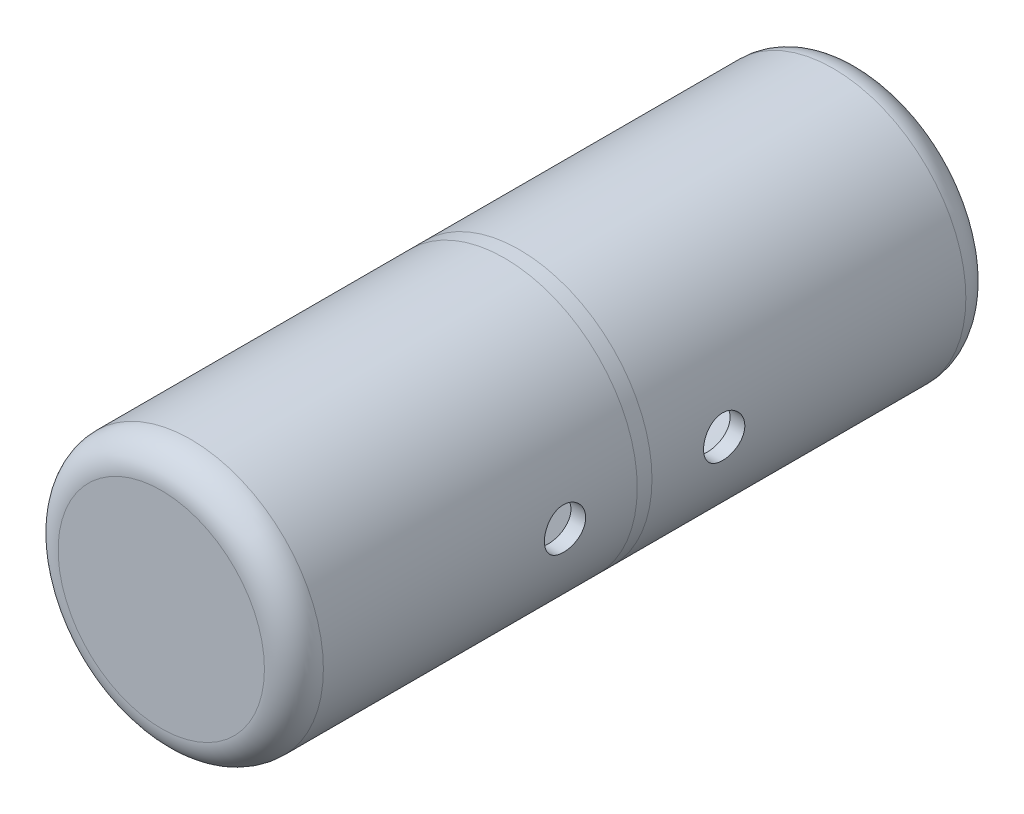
from build123d import *

# Parameters (mm, degrees)
P_IDAT_VYSUNUT_M1_DEPTH      = 2.5
P_IDAT_VYSUNUT_M1_DEPTH_BACK = 2.5
SKICA1_R                     = 45
SKICA2_R                     = 45
P_IDAT_VYSUNUT_M2_DEPTH      = 116.5
SKICA3_R                     = 45
P_IDAT_VYSUNUT_M3_DEPTH      = 116.5
ZAOBLIT1_R                   = 10
ZAOBLIT2_R                   = 10
SKO_EPINA1_T                 = -5
SKO_EPINA2_T                 = -5
SKICA4_R                     = 7
ODEBRAT_VYSUNUT_M1_DEPTH     = 50
SKICA5_R                     = 8
ODEBRAT_VYSUNUT_M2_DEPTH     = 50


with BuildPart() as part:
    # Skica1 → P_idat vysunut_m1 (new, two sides: drawn at the far end of the back side and taken through both)
    with BuildSketch(Plane.XY.offset(-P_IDAT_VYSUNUT_M1_DEPTH_BACK)):
        Circle(SKICA1_R)
    extrude(amount=P_IDAT_VYSUNUT_M1_DEPTH + P_IDAT_VYSUNUT_M1_DEPTH_BACK)


with BuildPart() as body_2:
    # Skica2 → P_idat vysunut_m2 (new body)
    with BuildSketch(Plane.XY.offset(2.5)):
        Circle(SKICA2_R)
    extrude(amount=P_IDAT_VYSUNUT_M2_DEPTH)

    # Zaoblit2
    zaoblit2_edges = [body_2.edges().sort_by_distance(p)[0] for p in [
        (-45, 0, 119),
    ]]
    fillet(zaoblit2_edges, radius=ZAOBLIT2_R)

    # Sko_epina1
    sko_epina1_openings = [body_2.faces().sort_by_distance(p)[0] for p in [
        (0, 0, 2.5),
    ]]
    offset(amount=SKO_EPINA1_T, openings=sko_epina1_openings, kind=Kind.INTERSECTION)


with BuildPart() as body_3:
    # Skica3 → P_idat vysunut_m3 (new body)
    with BuildSketch(Plane(origin=(0, 0, -2.5), x_dir=(-1, 0, 0), z_dir=(0, 0, -1))):
        Circle(SKICA3_R)
    extrude(amount=P_IDAT_VYSUNUT_M3_DEPTH)

    # Zaoblit1
    zaoblit1_edges = [body_3.edges().sort_by_distance(p)[0] for p in [
        (45, 0, -119),
    ]]
    fillet(zaoblit1_edges, radius=ZAOBLIT1_R)

    # Sko_epina2
    sko_epina2_openings = [body_3.faces().sort_by_distance(p)[0] for p in [
        (0, 0, -2.5),
    ]]
    offset(amount=SKO_EPINA2_T, openings=sko_epina2_openings, kind=Kind.INTERSECTION)


with BuildPart() as odebrat_vysunut_m1_tool:
    # Skica4 → Odebrat vysunut_m1 (new body)
    with BuildSketch(Plane(origin=(0, 0, 0), x_dir=(0, 0, -1), z_dir=(1, 0, 0))):
        with Locations(Location((-27, 0, 0), (0, 0, 180))):
            Circle(SKICA4_R)
        with Locations((27, 0)):
            Circle(SKICA4_R)
    extrude(amount=ODEBRAT_VYSUNUT_M1_DEPTH)


with BuildPart() as body_2_1:
    add(body_2.part)

    # Odebrat vysunut_m1: cut by odebrat_vysunut_m1_tool
    add(odebrat_vysunut_m1_tool.part, mode=Mode.SUBTRACT)


with BuildPart() as body_3_1:
    add(body_3.part)

    # Odebrat vysunut_m1: cut by odebrat_vysunut_m1_tool
    add(odebrat_vysunut_m1_tool.part, mode=Mode.SUBTRACT)


with BuildPart() as odebrat_vysunut_m2_tool:
    # Skica5 → Odebrat vysunut_m2 (new body)
    with BuildSketch(Plane(origin=(0, 0, 0), x_dir=(1, 0, 0), z_dir=(0, 1, 0))):
        with Locations(Location((0, -27, 0), (0, 0, 270))):
            Circle(SKICA5_R)
        with Locations(Location((0, 27, 0), (0, 0, 270))):
            Circle(SKICA5_R)
    extrude(amount=-ODEBRAT_VYSUNUT_M2_DEPTH)


with BuildPart() as body_2_2:
    add(body_2_1.part)

    # Odebrat vysunut_m2: cut by odebrat_vysunut_m2_tool
    add(odebrat_vysunut_m2_tool.part, mode=Mode.SUBTRACT)


with BuildPart() as body_3_2:
    add(body_3_1.part)

    # Odebrat vysunut_m2: cut by odebrat_vysunut_m2_tool
    add(odebrat_vysunut_m2_tool.part, mode=Mode.SUBTRACT)


solid = Compound([part.part, body_2_2.part, body_3_2.part])
